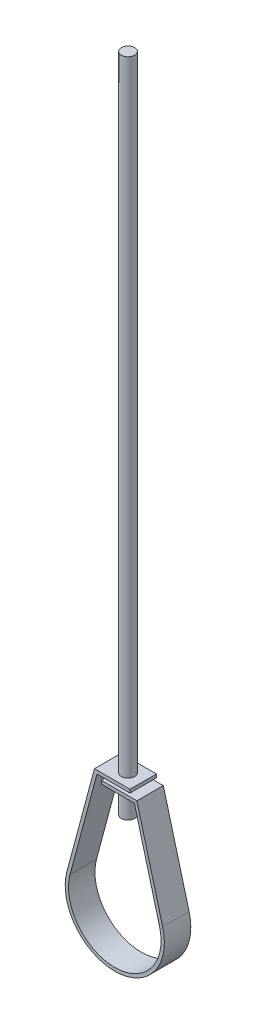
ISO-10303-21;
HEADER;
FILE_DESCRIPTION(('STEP AP214'),'2;1');
FILE_NAME('part.step','',(''),(''),'','','');
FILE_SCHEMA(('AUTOMOTIVE_DESIGN { 1 0 10303 214 1 1 1 1 }'));
ENDSEC;
DATA;
#1=APPLICATION_CONTEXT('core data for automotive mechanical design processes');
#2=APPLICATION_PROTOCOL_DEFINITION('international standard','automotive_design',2000,#1);
#3=PRODUCT_CONTEXT('',#1,'mechanical');
#4=PRODUCT('Part','Part','',(#3));
#5=PRODUCT_RELATED_PRODUCT_CATEGORY('part','',(#4));
#6=PRODUCT_DEFINITION_FORMATION('','',#4);
#7=PRODUCT_DEFINITION_CONTEXT('part definition',#1,'design');
#8=PRODUCT_DEFINITION('design','',#6,#7);
#9=PRODUCT_DEFINITION_SHAPE('','',#8);
#10=(LENGTH_UNIT() NAMED_UNIT(*) SI_UNIT(.MILLI.,.METRE.));
#11=(NAMED_UNIT(*) PLANE_ANGLE_UNIT() SI_UNIT($,.RADIAN.));
#12=(NAMED_UNIT(*) SI_UNIT($,.STERADIAN.) SOLID_ANGLE_UNIT());
#13=UNCERTAINTY_MEASURE_WITH_UNIT(LENGTH_MEASURE(1.E-05),#10,'distance_accuracy_value','');
#14=(GEOMETRIC_REPRESENTATION_CONTEXT(3) GLOBAL_UNCERTAINTY_ASSIGNED_CONTEXT((#13)) GLOBAL_UNIT_ASSIGNED_CONTEXT((#10,
#11,#12)) REPRESENTATION_CONTEXT('',''));
#15=CARTESIAN_POINT('',(0.,0.,0.));
#16=DIRECTION('',(0.,0.,1.));
#17=DIRECTION('',(1.,0.,0.));
#18=AXIS2_PLACEMENT_3D('',#15,#16,#17);
#19=CARTESIAN_POINT('',(-17.0929108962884,107.95,12.7));
#20=DIRECTION('',(0.,1.,0.));
#21=DIRECTION('',(0.,0.,1.));
#22=AXIS2_PLACEMENT_3D('',#19,#20,#21);
#23=PLANE('',#22);
#24=DIRECTION('',(1.,0.,0.));
#25=VECTOR('',#24,1.);
#26=CARTESIAN_POINT('',(-17.0929108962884,107.95,-12.7));
#27=LINE('',#26,#25);
#28=CARTESIAN_POINT('',(-17.0929108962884,107.95,-12.7));
#29=VERTEX_POINT('',#28);
#30=CARTESIAN_POINT('',(14.6570891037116,107.95,-12.7));
#31=VERTEX_POINT('',#30);
#32=EDGE_CURVE('E154',#29,#31,#27,.T.);
#33=ORIENTED_EDGE('',*,*,#32,.T.);
#34=DIRECTION('',(0.,0.,-1.));
#35=VECTOR('',#34,1.);
#36=CARTESIAN_POINT('',(14.6570891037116,107.95,12.7));
#37=LINE('',#36,#35);
#38=CARTESIAN_POINT('',(14.6570891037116,107.95,12.7));
#39=VERTEX_POINT('',#38);
#40=EDGE_CURVE('E200',#39,#31,#37,.T.);
#41=ORIENTED_EDGE('',*,*,#40,.F.);
#42=DIRECTION('',(1.,0.,0.));
#43=VECTOR('',#42,1.);
#44=CARTESIAN_POINT('',(-17.0929108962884,107.95,12.7));
#45=LINE('',#44,#43);
#46=CARTESIAN_POINT('',(-17.0929108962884,107.95,12.7));
#47=VERTEX_POINT('',#46);
#48=EDGE_CURVE('E102',#47,#39,#45,.T.);
#49=ORIENTED_EDGE('',*,*,#48,.F.);
#50=DIRECTION('',(0.,0.,-1.));
#51=VECTOR('',#50,1.);
#52=CARTESIAN_POINT('',(-17.0929108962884,107.95,12.7));
#53=LINE('',#52,#51);
#54=EDGE_CURVE('E150',#47,#29,#53,.T.);
#55=ORIENTED_EDGE('',*,*,#54,.T.);
#56=EDGE_LOOP('',(#33,#41,#49,#55));
#57=FACE_BOUND('',#56,.T.);
#58=CARTESIAN_POINT('',(0.,107.95,0.));
#59=DIRECTION('',(0.,1.,0.));
#60=DIRECTION('',(0.,0.,1.));
#61=AXIS2_PLACEMENT_3D('',#58,#59,#60);
#62=CIRCLE('',#61,6.35);
#63=CARTESIAN_POINT('',(0.,107.95,-6.35));
#64=VERTEX_POINT('',#63);
#65=EDGE_CURVE('E11',#64,#64,#62,.F.);
#66=ORIENTED_EDGE('',*,*,#65,.F.);
#67=EDGE_LOOP('',(#66));
#68=FACE_BOUND('',#67,.T.);
#69=ADVANCED_FACE('F32',(#57,#68),#23,.F.);
#70=CARTESIAN_POINT('',(-17.0929108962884,111.125,12.7));
#71=DIRECTION('',(0.,1.,0.));
#72=DIRECTION('',(0.,0.,1.));
#73=AXIS2_PLACEMENT_3D('',#70,#71,#72);
#74=PLANE('',#73);
#75=DIRECTION('',(1.,0.,0.));
#76=VECTOR('',#75,1.);
#77=CARTESIAN_POINT('',(-17.0929108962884,111.125,-12.7));
#78=LINE('',#77,#76);
#79=CARTESIAN_POINT('',(-19.5291740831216,111.125,-12.7));
#80=VERTEX_POINT('',#79);
#81=CARTESIAN_POINT('',(14.6570891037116,111.125,-12.7));
#82=VERTEX_POINT('',#81);
#83=EDGE_CURVE('E161',#80,#82,#78,.T.);
#84=ORIENTED_EDGE('',*,*,#83,.F.);
#85=DIRECTION('',(0.,0.,-1.));
#86=VECTOR('',#85,1.);
#87=CARTESIAN_POINT('',(-19.5291740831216,111.125,12.7));
#88=LINE('',#87,#86);
#89=CARTESIAN_POINT('',(-19.5291740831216,111.125,12.7));
#90=VERTEX_POINT('',#89);
#91=EDGE_CURVE('E197',#90,#80,#88,.T.);
#92=ORIENTED_EDGE('',*,*,#91,.F.);
#93=DIRECTION('',(1.,0.,0.));
#94=VECTOR('',#93,1.);
#95=CARTESIAN_POINT('',(-17.0929108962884,111.125,12.7));
#96=LINE('',#95,#94);
#97=CARTESIAN_POINT('',(14.6570891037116,111.125,12.7));
#98=VERTEX_POINT('',#97);
#99=EDGE_CURVE('E301',#90,#98,#96,.T.);
#100=ORIENTED_EDGE('',*,*,#99,.T.);
#101=DIRECTION('',(0.,0.,-1.));
#102=VECTOR('',#101,1.);
#103=CARTESIAN_POINT('',(14.6570891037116,111.125,12.7));
#104=LINE('',#103,#102);
#105=EDGE_CURVE('E199',#98,#82,#104,.T.);
#106=ORIENTED_EDGE('',*,*,#105,.T.);
#107=EDGE_LOOP('',(#84,#92,#100,#106));
#108=FACE_BOUND('',#107,.T.);
#109=CARTESIAN_POINT('',(0.,111.125,0.));
#110=DIRECTION('',(0.,1.,0.));
#111=DIRECTION('',(0.,0.,1.));
#112=AXIS2_PLACEMENT_3D('',#109,#110,#111);
#113=CIRCLE('',#112,6.35);
#114=CARTESIAN_POINT('',(0.,111.125,-6.35));
#115=VERTEX_POINT('',#114);
#116=EDGE_CURVE('E158',#115,#115,#113,.F.);
#117=ORIENTED_EDGE('',*,*,#116,.T.);
#118=EDGE_LOOP('',(#117));
#119=FACE_BOUND('',#118,.T.);
#120=ADVANCED_FACE('F220',(#108,#119),#74,.T.);
#121=CARTESIAN_POINT('',(-12.9556117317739,104.775,12.7));
#122=DIRECTION('',(0.,1.,0.));
#123=DIRECTION('',(0.,0.,1.));
#124=AXIS2_PLACEMENT_3D('',#121,#122,#123);
#125=PLANE('',#124);
#126=DIRECTION('',(1.,0.,0.));
#127=VECTOR('',#126,1.);
#128=CARTESIAN_POINT('',(-12.9556117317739,104.775,-12.7));
#129=LINE('',#128,#127);
#130=CARTESIAN_POINT('',(-12.9556117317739,104.775,-12.7));
#131=VERTEX_POINT('',#130);
#132=CARTESIAN_POINT('',(21.2306514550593,104.775,-12.7));
#133=VERTEX_POINT('',#132);
#134=EDGE_CURVE('E173',#131,#133,#129,.T.);
#135=ORIENTED_EDGE('',*,*,#134,.F.);
#136=DIRECTION('',(0.,0.,-1.));
#137=VECTOR('',#136,1.);
#138=CARTESIAN_POINT('',(-12.9556117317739,104.775,12.7));
#139=LINE('',#138,#137);
#140=CARTESIAN_POINT('',(-12.9556117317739,104.775,12.7));
#141=VERTEX_POINT('',#140);
#142=EDGE_CURVE('E189',#141,#131,#139,.T.);
#143=ORIENTED_EDGE('',*,*,#142,.F.);
#144=DIRECTION('',(1.,0.,0.));
#145=VECTOR('',#144,1.);
#146=CARTESIAN_POINT('',(-12.9556117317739,104.775,12.7));
#147=LINE('',#146,#145);
#148=CARTESIAN_POINT('',(21.2306514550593,104.775,12.7));
#149=VERTEX_POINT('',#148);
#150=EDGE_CURVE('E299',#141,#149,#147,.T.);
#151=ORIENTED_EDGE('',*,*,#150,.T.);
#152=DIRECTION('',(0.,0.,-1.));
#153=VECTOR('',#152,1.);
#154=CARTESIAN_POINT('',(21.2306514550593,104.775,12.7));
#155=LINE('',#154,#153);
#156=EDGE_CURVE('E191',#149,#133,#155,.T.);
#157=ORIENTED_EDGE('',*,*,#156,.T.);
#158=EDGE_LOOP('',(#135,#143,#151,#157));
#159=FACE_BOUND('',#158,.T.);
#160=CARTESIAN_POINT('',(0.,104.775,0.));
#161=DIRECTION('',(0.,1.,0.));
#162=DIRECTION('',(0.,0.,1.));
#163=AXIS2_PLACEMENT_3D('',#160,#161,#162);
#164=CIRCLE('',#163,6.35);
#165=CARTESIAN_POINT('',(0.,104.775,-6.35));
#166=VERTEX_POINT('',#165);
#167=EDGE_CURVE('E322',#166,#166,#164,.F.);
#168=ORIENTED_EDGE('',*,*,#167,.T.);
#169=EDGE_LOOP('',(#168));
#170=FACE_BOUND('',#169,.T.);
#171=ADVANCED_FACE('F212',(#159,#170),#125,.T.);
#172=CARTESIAN_POINT('',(-12.9556117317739,101.6,12.7));
#173=DIRECTION('',(0.,1.,0.));
#174=DIRECTION('',(0.,0.,1.));
#175=AXIS2_PLACEMENT_3D('',#172,#173,#174);
#176=PLANE('',#175);
#177=DIRECTION('',(1.,0.,0.));
#178=VECTOR('',#177,1.);
#179=CARTESIAN_POINT('',(-12.9556117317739,101.6,-12.7));
#180=LINE('',#179,#178);
#181=CARTESIAN_POINT('',(-12.9556117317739,101.6,-12.7));
#182=VERTEX_POINT('',#181);
#183=CARTESIAN_POINT('',(18.7943882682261,101.6,-12.7));
#184=VERTEX_POINT('',#183);
#185=EDGE_CURVE('E179',#182,#184,#180,.T.);
#186=ORIENTED_EDGE('',*,*,#185,.T.);
#187=DIRECTION('',(0.,0.,-1.));
#188=VECTOR('',#187,1.);
#189=CARTESIAN_POINT('',(18.7943882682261,101.6,12.7));
#190=LINE('',#189,#188);
#191=CARTESIAN_POINT('',(18.7943882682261,101.6,12.7));
#192=VERTEX_POINT('',#191);
#193=EDGE_CURVE('E145',#192,#184,#190,.T.);
#194=ORIENTED_EDGE('',*,*,#193,.F.);
#195=DIRECTION('',(1.,0.,0.));
#196=VECTOR('',#195,1.);
#197=CARTESIAN_POINT('',(-12.9556117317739,101.6,12.7));
#198=LINE('',#197,#196);
#199=CARTESIAN_POINT('',(-12.9556117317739,101.6,12.7));
#200=VERTEX_POINT('',#199);
#201=EDGE_CURVE('E136',#200,#192,#198,.T.);
#202=ORIENTED_EDGE('',*,*,#201,.F.);
#203=DIRECTION('',(0.,0.,-1.));
#204=VECTOR('',#203,1.);
#205=CARTESIAN_POINT('',(-12.9556117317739,101.6,12.7));
#206=LINE('',#205,#204);
#207=EDGE_CURVE('E187',#200,#182,#206,.T.);
#208=ORIENTED_EDGE('',*,*,#207,.T.);
#209=EDGE_LOOP('',(#186,#194,#202,#208));
#210=FACE_BOUND('',#209,.T.);
#211=CARTESIAN_POINT('',(0.,101.6,0.));
#212=DIRECTION('',(0.,1.,0.));
#213=DIRECTION('',(0.,0.,1.));
#214=AXIS2_PLACEMENT_3D('',#211,#212,#213);
#215=CIRCLE('',#214,6.35);
#216=CARTESIAN_POINT('',(0.,101.6,-6.35));
#217=VERTEX_POINT('',#216);
#218=EDGE_CURVE('E35',#217,#217,#215,.F.);
#219=ORIENTED_EDGE('',*,*,#218,.F.);
#220=EDGE_LOOP('',(#219));
#221=FACE_BOUND('',#220,.T.);
#222=ADVANCED_FACE('F209',(#210,#221),#176,.F.);
#223=CARTESIAN_POINT('',(14.6570891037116,111.125,12.7));
#224=DIRECTION('',(1.,0.,0.));
#225=DIRECTION('',(0.,0.,-1.));
#226=AXIS2_PLACEMENT_3D('',#223,#224,#225);
#227=PLANE('',#226);
#228=DIRECTION('',(0.,-1.,0.));
#229=VECTOR('',#228,1.);
#230=CARTESIAN_POINT('',(14.6570891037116,111.125,-12.7));
#231=LINE('',#230,#229);
#232=EDGE_CURVE('E157',#82,#31,#231,.T.);
#233=ORIENTED_EDGE('',*,*,#232,.F.);
#234=ORIENTED_EDGE('',*,*,#105,.F.);
#235=DIRECTION('',(0.,-1.,0.));
#236=VECTOR('',#235,1.);
#237=CARTESIAN_POINT('',(14.6570891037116,111.125,12.7));
#238=LINE('',#237,#236);
#239=EDGE_CURVE('E313',#98,#39,#238,.T.);
#240=ORIENTED_EDGE('',*,*,#239,.T.);
#241=ORIENTED_EDGE('',*,*,#40,.T.);
#242=EDGE_LOOP('',(#233,#234,#240,#241));
#243=FACE_BOUND('',#242,.T.);
#244=ADVANCED_FACE('F211',(#243),#227,.T.);
#245=CARTESIAN_POINT('',(-46.0022174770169,12.3262570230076,12.7));
#246=DIRECTION('',(-0.965925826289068,0.258819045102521,0.));
#247=DIRECTION('',(-0.258819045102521,-0.965925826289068,0.));
#248=AXIS2_PLACEMENT_3D('',#245,#246,#247);
#249=PLANE('',#248);
#250=DIRECTION('',(0.258819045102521,0.965925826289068,0.));
#251=VECTOR('',#250,1.);
#252=CARTESIAN_POINT('',(-46.0022174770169,12.3262570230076,-12.7));
#253=LINE('',#252,#251);
#254=CARTESIAN_POINT('',(-46.0022174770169,12.3262570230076,-12.7));
#255=VERTEX_POINT('',#254);
#256=EDGE_CURVE('E164',#255,#80,#253,.T.);
#257=ORIENTED_EDGE('',*,*,#256,.F.);
#258=DIRECTION('',(0.,0.,-1.));
#259=VECTOR('',#258,1.);
#260=CARTESIAN_POINT('',(-46.0022174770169,12.3262570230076,12.7));
#261=LINE('',#260,#259);
#262=CARTESIAN_POINT('',(-46.0022174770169,12.3262570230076,12.7));
#263=VERTEX_POINT('',#262);
#264=EDGE_CURVE('E195',#263,#255,#261,.T.);
#265=ORIENTED_EDGE('',*,*,#264,.F.);
#266=DIRECTION('',(0.258819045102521,0.965925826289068,0.));
#267=VECTOR('',#266,1.);
#268=CARTESIAN_POINT('',(-46.0022174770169,12.3262570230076,12.7));
#269=LINE('',#268,#267);
#270=EDGE_CURVE('E297',#263,#90,#269,.T.);
#271=ORIENTED_EDGE('',*,*,#270,.T.);
#272=ORIENTED_EDGE('',*,*,#91,.T.);
#273=EDGE_LOOP('',(#257,#265,#271,#272));
#274=FACE_BOUND('',#273,.T.);
#275=ADVANCED_FACE('F219',(#274),#249,.T.);
#276=CARTESIAN_POINT('',(0.,0.,12.7));
#277=DIRECTION('',(0.,0.,-1.));
#278=DIRECTION('',(-1.,0.,0.));
#279=AXIS2_PLACEMENT_3D('',#276,#277,#278);
#280=CYLINDRICAL_SURFACE('',#279,47.625);
#281=CARTESIAN_POINT('',(0.,0.,-12.7));
#282=DIRECTION('',(0.,0.,1.));
#283=DIRECTION('',(1.,0.,0.));
#284=AXIS2_PLACEMENT_3D('',#281,#282,#283);
#285=CIRCLE('',#284,47.625);
#286=CARTESIAN_POINT('',(46.0022174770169,12.3262570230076,-12.7));
#287=VERTEX_POINT('',#286);
#288=EDGE_CURVE('E167',#287,#255,#285,.F.);
#289=ORIENTED_EDGE('',*,*,#288,.F.);
#290=DIRECTION('',(0.,0.,-1.));
#291=VECTOR('',#290,1.);
#292=CARTESIAN_POINT('',(46.0022174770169,12.3262570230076,12.7));
#293=LINE('',#292,#291);
#294=CARTESIAN_POINT('',(46.0022174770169,12.3262570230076,12.7));
#295=VERTEX_POINT('',#294);
#296=EDGE_CURVE('E193',#295,#287,#293,.T.);
#297=ORIENTED_EDGE('',*,*,#296,.F.);
#298=CARTESIAN_POINT('',(0.,0.,12.7));
#299=DIRECTION('',(0.,0.,1.));
#300=DIRECTION('',(1.,0.,0.));
#301=AXIS2_PLACEMENT_3D('',#298,#299,#300);
#302=CIRCLE('',#301,47.625);
#303=EDGE_CURVE('E293',#295,#263,#302,.F.);
#304=ORIENTED_EDGE('',*,*,#303,.T.);
#305=ORIENTED_EDGE('',*,*,#264,.T.);
#306=EDGE_LOOP('',(#289,#297,#304,#305));
#307=FACE_BOUND('',#306,.T.);
#308=ADVANCED_FACE('F273',(#307),#280,.T.);
#309=CARTESIAN_POINT('',(21.8612027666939,102.421750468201,12.7));
#310=DIRECTION('',(0.965925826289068,0.258819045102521,0.));
#311=DIRECTION('',(-0.258819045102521,0.965925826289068,0.));
#312=AXIS2_PLACEMENT_3D('',#309,#310,#311);
#313=PLANE('',#312);
#314=DIRECTION('',(0.258819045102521,-0.965925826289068,0.));
#315=VECTOR('',#314,1.);
#316=CARTESIAN_POINT('',(21.8612027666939,102.421750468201,-12.7));
#317=LINE('',#316,#315);
#318=EDGE_CURVE('E170',#133,#287,#317,.T.);
#319=ORIENTED_EDGE('',*,*,#318,.F.);
#320=ORIENTED_EDGE('',*,*,#156,.F.);
#321=DIRECTION('',(0.258819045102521,-0.965925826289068,0.));
#322=VECTOR('',#321,1.);
#323=CARTESIAN_POINT('',(21.8612027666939,102.421750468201,12.7));
#324=LINE('',#323,#322);
#325=EDGE_CURVE('E296',#149,#295,#324,.T.);
#326=ORIENTED_EDGE('',*,*,#325,.T.);
#327=ORIENTED_EDGE('',*,*,#296,.T.);
#328=EDGE_LOOP('',(#319,#320,#326,#327));
#329=FACE_BOUND('',#328,.T.);
#330=ADVANCED_FACE('F268',(#329),#313,.T.);
#331=CARTESIAN_POINT('',(-12.9556117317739,101.6,12.7));
#332=DIRECTION('',(-1.,0.,0.));
#333=DIRECTION('',(0.,0.,1.));
#334=AXIS2_PLACEMENT_3D('',#331,#332,#333);
#335=PLANE('',#334);
#336=DIRECTION('',(0.,1.,0.));
#337=VECTOR('',#336,1.);
#338=CARTESIAN_POINT('',(-12.9556117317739,101.6,-12.7));
#339=LINE('',#338,#337);
#340=EDGE_CURVE('E176',#182,#131,#339,.T.);
#341=ORIENTED_EDGE('',*,*,#340,.F.);
#342=ORIENTED_EDGE('',*,*,#207,.F.);
#343=DIRECTION('',(0.,1.,0.));
#344=VECTOR('',#343,1.);
#345=CARTESIAN_POINT('',(-12.9556117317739,101.6,12.7));
#346=LINE('',#345,#344);
#347=EDGE_CURVE('E307',#200,#141,#346,.T.);
#348=ORIENTED_EDGE('',*,*,#347,.T.);
#349=ORIENTED_EDGE('',*,*,#142,.T.);
#350=EDGE_LOOP('',(#341,#342,#348,#349));
#351=FACE_BOUND('',#350,.T.);
#352=ADVANCED_FACE('F264',(#351),#335,.T.);
#353=CARTESIAN_POINT('',(18.7943882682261,101.6,12.7));
#354=DIRECTION('',(0.965925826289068,0.258819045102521,0.));
#355=DIRECTION('',(-0.258819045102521,0.965925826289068,0.));
#356=AXIS2_PLACEMENT_3D('',#353,#354,#355);
#357=PLANE('',#356);
#358=DIRECTION('',(0.258819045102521,-0.965925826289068,0.));
#359=VECTOR('',#358,1.);
#360=CARTESIAN_POINT('',(18.7943882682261,101.6,-12.7));
#361=LINE('',#360,#359);
#362=CARTESIAN_POINT('',(42.9354029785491,11.5045065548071,-12.7));
#363=VERTEX_POINT('',#362);
#364=EDGE_CURVE('E144',#184,#363,#361,.T.);
#365=ORIENTED_EDGE('',*,*,#364,.T.);
#366=DIRECTION('',(0.,0.,-1.));
#367=VECTOR('',#366,1.);
#368=CARTESIAN_POINT('',(42.9354029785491,11.5045065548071,12.7));
#369=LINE('',#368,#367);
#370=CARTESIAN_POINT('',(42.9354029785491,11.5045065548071,12.7));
#371=VERTEX_POINT('',#370);
#372=EDGE_CURVE('E141',#371,#363,#369,.T.);
#373=ORIENTED_EDGE('',*,*,#372,.F.);
#374=DIRECTION('',(0.258819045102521,-0.965925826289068,0.));
#375=VECTOR('',#374,1.);
#376=CARTESIAN_POINT('',(18.7943882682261,101.6,12.7));
#377=LINE('',#376,#375);
#378=EDGE_CURVE('E129',#192,#371,#377,.T.);
#379=ORIENTED_EDGE('',*,*,#378,.F.);
#380=ORIENTED_EDGE('',*,*,#193,.T.);
#381=EDGE_LOOP('',(#365,#373,#379,#380));
#382=FACE_BOUND('',#381,.T.);
#383=ADVANCED_FACE('F142',(#382),#357,.F.);
#384=CARTESIAN_POINT('',(0.,0.,12.7));
#385=DIRECTION('',(0.,0.,-1.));
#386=DIRECTION('',(-1.,0.,0.));
#387=AXIS2_PLACEMENT_3D('',#384,#385,#386);
#388=CYLINDRICAL_SURFACE('',#387,44.45);
#389=CARTESIAN_POINT('',(0.,0.,-12.7));
#390=DIRECTION('',(0.,0.,-1.));
#391=DIRECTION('',(-1.,0.,0.));
#392=AXIS2_PLACEMENT_3D('',#389,#390,#391);
#393=CIRCLE('',#392,44.45);
#394=CARTESIAN_POINT('',(-42.9354029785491,11.5045065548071,-12.7));
#395=VERTEX_POINT('',#394);
#396=EDGE_CURVE('E90',#363,#395,#393,.T.);
#397=ORIENTED_EDGE('',*,*,#396,.T.);
#398=DIRECTION('',(0.,0.,-1.));
#399=VECTOR('',#398,1.);
#400=CARTESIAN_POINT('',(-42.9354029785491,11.5045065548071,12.7));
#401=LINE('',#400,#399);
#402=CARTESIAN_POINT('',(-42.9354029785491,11.5045065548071,12.7));
#403=VERTEX_POINT('',#402);
#404=EDGE_CURVE('E146',#403,#395,#401,.T.);
#405=ORIENTED_EDGE('',*,*,#404,.F.);
#406=CARTESIAN_POINT('',(0.,0.,12.7));
#407=DIRECTION('',(0.,0.,-1.));
#408=DIRECTION('',(-1.,0.,0.));
#409=AXIS2_PLACEMENT_3D('',#406,#407,#408);
#410=CIRCLE('',#409,44.45);
#411=EDGE_CURVE('E133',#371,#403,#410,.T.);
#412=ORIENTED_EDGE('',*,*,#411,.F.);
#413=ORIENTED_EDGE('',*,*,#372,.T.);
#414=EDGE_LOOP('',(#397,#405,#412,#413));
#415=FACE_BOUND('',#414,.T.);
#416=ADVANCED_FACE('F148',(#415),#388,.F.);
#417=CARTESIAN_POINT('',(-42.9354029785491,11.5045065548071,12.7));
#418=DIRECTION('',(-0.965925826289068,0.258819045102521,0.));
#419=DIRECTION('',(-0.258819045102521,-0.965925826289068,0.));
#420=AXIS2_PLACEMENT_3D('',#417,#418,#419);
#421=PLANE('',#420);
#422=DIRECTION('',(0.258819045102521,0.965925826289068,0.));
#423=VECTOR('',#422,1.);
#424=CARTESIAN_POINT('',(-42.9354029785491,11.5045065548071,-12.7));
#425=LINE('',#424,#423);
#426=EDGE_CURVE('E96',#395,#29,#425,.T.);
#427=ORIENTED_EDGE('',*,*,#426,.T.);
#428=ORIENTED_EDGE('',*,*,#54,.F.);
#429=DIRECTION('',(0.258819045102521,0.965925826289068,0.));
#430=VECTOR('',#429,1.);
#431=CARTESIAN_POINT('',(-42.9354029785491,11.5045065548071,12.7));
#432=LINE('',#431,#430);
#433=EDGE_CURVE('E49',#403,#47,#432,.T.);
#434=ORIENTED_EDGE('',*,*,#433,.F.);
#435=ORIENTED_EDGE('',*,*,#404,.T.);
#436=EDGE_LOOP('',(#427,#428,#434,#435));
#437=FACE_BOUND('',#436,.T.);
#438=ADVANCED_FACE('F256',(#437),#421,.F.);
#439=CARTESIAN_POINT('',(0.,0.,12.7));
#440=DIRECTION('',(0.,0.,1.));
#441=DIRECTION('',(1.,0.,0.));
#442=AXIS2_PLACEMENT_3D('',#439,#440,#441);
#443=PLANE('',#442);
#444=ORIENTED_EDGE('',*,*,#48,.T.);
#445=ORIENTED_EDGE('',*,*,#239,.F.);
#446=ORIENTED_EDGE('',*,*,#99,.F.);
#447=ORIENTED_EDGE('',*,*,#270,.F.);
#448=ORIENTED_EDGE('',*,*,#303,.F.);
#449=ORIENTED_EDGE('',*,*,#325,.F.);
#450=ORIENTED_EDGE('',*,*,#150,.F.);
#451=ORIENTED_EDGE('',*,*,#347,.F.);
#452=ORIENTED_EDGE('',*,*,#201,.T.);
#453=ORIENTED_EDGE('',*,*,#378,.T.);
#454=ORIENTED_EDGE('',*,*,#411,.T.);
#455=ORIENTED_EDGE('',*,*,#433,.T.);
#456=EDGE_LOOP('',(#444,#445,#446,#447,#448,#449,#450,#451,#452,#453,#454,#455));
#457=FACE_BOUND('',#456,.T.);
#458=ADVANCED_FACE('F131',(#457),#443,.T.);
#459=CARTESIAN_POINT('',(0.,0.,-12.7));
#460=DIRECTION('',(0.,0.,1.));
#461=DIRECTION('',(1.,0.,0.));
#462=AXIS2_PLACEMENT_3D('',#459,#460,#461);
#463=PLANE('',#462);
#464=ORIENTED_EDGE('',*,*,#32,.F.);
#465=ORIENTED_EDGE('',*,*,#426,.F.);
#466=ORIENTED_EDGE('',*,*,#396,.F.);
#467=ORIENTED_EDGE('',*,*,#364,.F.);
#468=ORIENTED_EDGE('',*,*,#185,.F.);
#469=ORIENTED_EDGE('',*,*,#340,.T.);
#470=ORIENTED_EDGE('',*,*,#134,.T.);
#471=ORIENTED_EDGE('',*,*,#318,.T.);
#472=ORIENTED_EDGE('',*,*,#288,.T.);
#473=ORIENTED_EDGE('',*,*,#256,.T.);
#474=ORIENTED_EDGE('',*,*,#83,.T.);
#475=ORIENTED_EDGE('',*,*,#232,.T.);
#476=EDGE_LOOP('',(#464,#465,#466,#467,#468,#469,#470,#471,#472,#473,#474,#475));
#477=FACE_BOUND('',#476,.T.);
#478=ADVANCED_FACE('F255',(#477),#463,.F.);
#479=CARTESIAN_POINT('',(0.,76.2,0.));
#480=DIRECTION('',(0.,1.,0.));
#481=DIRECTION('',(0.,0.,1.));
#482=AXIS2_PLACEMENT_3D('',#479,#480,#481);
#483=PLANE('',#482);
#484=CARTESIAN_POINT('',(0.,76.2,0.));
#485=DIRECTION('',(0.,1.,0.));
#486=DIRECTION('',(0.,0.,1.));
#487=AXIS2_PLACEMENT_3D('',#484,#485,#486);
#488=CIRCLE('',#487,6.35);
#489=CARTESIAN_POINT('',(0.,76.1999999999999,-6.35));
#490=VERTEX_POINT('',#489);
#491=EDGE_CURVE('E328',#490,#490,#488,.T.);
#492=ORIENTED_EDGE('',*,*,#491,.F.);
#493=EDGE_LOOP('',(#492));
#494=FACE_BOUND('',#493,.T.);
#495=ADVANCED_FACE('F247',(#494),#483,.F.);
#496=CARTESIAN_POINT('',(0.,711.2,0.));
#497=DIRECTION('',(0.,-1.,0.));
#498=DIRECTION('',(0.,0.,-1.));
#499=AXIS2_PLACEMENT_3D('',#496,#497,#498);
#500=CYLINDRICAL_SURFACE('',#499,6.35);
#501=CARTESIAN_POINT('',(0.,76.1999999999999,-6.35));
#502=CARTESIAN_POINT('',(0.,76.4645833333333,-6.35));
#503=CARTESIAN_POINT('',(0.,76.7291666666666,-6.35));
#504=CARTESIAN_POINT('',(0.,77.2583333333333,-6.35));
#505=CARTESIAN_POINT('',(0.,77.5229166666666,-6.35));
#506=CARTESIAN_POINT('',(0.,78.0520833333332,-6.35));
#507=CARTESIAN_POINT('',(0.,78.3166666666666,-6.35));
#508=CARTESIAN_POINT('',(0.,78.8458333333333,-6.35));
#509=CARTESIAN_POINT('',(0.,79.1104166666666,-6.35));
#510=CARTESIAN_POINT('',(0.,79.6395833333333,-6.35));
#511=CARTESIAN_POINT('',(0.,79.9041666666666,-6.35));
#512=CARTESIAN_POINT('',(0.,80.4333333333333,-6.35));
#513=CARTESIAN_POINT('',(0.,80.6979166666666,-6.35));
#514=CARTESIAN_POINT('',(0.,81.2270833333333,-6.35));
#515=CARTESIAN_POINT('',(0.,81.4916666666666,-6.35));
#516=CARTESIAN_POINT('',(0.,82.0208333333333,-6.35));
#517=CARTESIAN_POINT('',(0.,82.2854166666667,-6.35));
#518=CARTESIAN_POINT('',(0.,82.8145833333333,-6.35));
#519=CARTESIAN_POINT('',(0.,83.0791666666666,-6.35));
#520=CARTESIAN_POINT('',(0.,83.6083333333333,-6.35));
#521=CARTESIAN_POINT('',(0.,83.8729166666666,-6.35));
#522=CARTESIAN_POINT('',(0.,84.4020833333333,-6.35));
#523=CARTESIAN_POINT('',(0.,84.6666666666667,-6.35));
#524=CARTESIAN_POINT('',(0.,85.1958333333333,-6.35));
#525=CARTESIAN_POINT('',(0.,85.4604166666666,-6.35));
#526=CARTESIAN_POINT('',(0.,85.9895833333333,-6.35));
#527=CARTESIAN_POINT('',(0.,86.2541666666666,-6.35));
#528=CARTESIAN_POINT('',(0.,86.7833333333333,-6.35));
#529=CARTESIAN_POINT('',(0.,87.0479166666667,-6.35));
#530=CARTESIAN_POINT('',(0.,87.5770833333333,-6.35));
#531=CARTESIAN_POINT('',(0.,87.8416666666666,-6.35));
#532=CARTESIAN_POINT('',(0.,88.3708333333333,-6.35));
#533=CARTESIAN_POINT('',(0.,88.6354166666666,-6.35));
#534=CARTESIAN_POINT('',(0.,89.1645833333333,-6.35));
#535=CARTESIAN_POINT('',(0.,89.4291666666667,-6.35));
#536=CARTESIAN_POINT('',(0.,89.9583333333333,-6.35));
#537=CARTESIAN_POINT('',(0.,90.2229166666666,-6.35));
#538=CARTESIAN_POINT('',(0.,90.7520833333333,-6.35));
#539=CARTESIAN_POINT('',(0.,91.0166666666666,-6.35));
#540=CARTESIAN_POINT('',(0.,91.5458333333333,-6.35));
#541=CARTESIAN_POINT('',(0.,91.8104166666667,-6.35));
#542=CARTESIAN_POINT('',(0.,92.3395833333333,-6.35));
#543=CARTESIAN_POINT('',(0.,92.6041666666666,-6.35));
#544=CARTESIAN_POINT('',(0.,93.1333333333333,-6.35));
#545=CARTESIAN_POINT('',(0.,93.3979166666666,-6.35));
#546=CARTESIAN_POINT('',(0.,93.9270833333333,-6.35));
#547=CARTESIAN_POINT('',(0.,94.1916666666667,-6.35));
#548=CARTESIAN_POINT('',(0.,94.7208333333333,-6.35));
#549=CARTESIAN_POINT('',(0.,94.9854166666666,-6.35));
#550=CARTESIAN_POINT('',(0.,95.5145833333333,-6.35));
#551=CARTESIAN_POINT('',(0.,95.7791666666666,-6.35));
#552=CARTESIAN_POINT('',(0.,96.3083333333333,-6.35));
#553=CARTESIAN_POINT('',(0.,96.5729166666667,-6.35));
#554=CARTESIAN_POINT('',(0.,97.1020833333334,-6.35));
#555=CARTESIAN_POINT('',(0.,97.3666666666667,-6.35));
#556=CARTESIAN_POINT('',(0.,97.8958333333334,-6.35));
#557=CARTESIAN_POINT('',(0.,98.1604166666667,-6.35));
#558=CARTESIAN_POINT('',(0.,98.6895833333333,-6.35));
#559=CARTESIAN_POINT('',(0.,98.9541666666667,-6.35));
#560=CARTESIAN_POINT('',(0.,99.4833333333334,-6.35));
#561=CARTESIAN_POINT('',(0.,99.7479166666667,-6.35));
#562=CARTESIAN_POINT('',(0.,100.277083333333,-6.35));
#563=CARTESIAN_POINT('',(0.,100.541666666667,-6.35));
#564=CARTESIAN_POINT('',(0.,101.070833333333,-6.35));
#565=CARTESIAN_POINT('',(0.,101.335416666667,-6.35));
#566=CARTESIAN_POINT('',(0.,101.6,-6.35));
#567=B_SPLINE_CURVE_WITH_KNOTS('',3,(#501,#502,#503,#504,#505,#506,#507,#508,#509,#510,#511,
#512,#513,#514,#515,#516,#517,#518,#519,#520,#521,#522,#523,#524,#525,#526,#527,#528,#529,#530,
#531,#532,#533,#534,#535,#536,#537,#538,#539,#540,#541,#542,#543,#544,#545,#546,#547,#548,#549,
#550,#551,#552,#553,#554,#555,#556,#557,#558,#559,#560,#561,#562,#563,#564,#565,#566),
.UNSPECIFIED.,.F.,.F.,(4,2,2,2,2,2,2,2,2,2,2,2,2,2,2,2,2,2,2,2,2,2,2,2,2,2,2,2,2,2,2,2,4),(0.,
0.793750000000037,1.58749999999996,2.38125,3.17500000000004,3.96874999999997,4.7625,
5.55625000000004,6.35000000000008,7.14375,7.93750000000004,8.73125000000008,9.52500000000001,
10.31875,11.1125000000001,11.90625,12.7,13.4937500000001,14.2875,15.08125,15.8750000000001,
16.66875,17.4625,18.2562500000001,19.05,19.84375,20.6375000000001,21.4312500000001,
22.2250000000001,23.0187500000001,23.8125000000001,24.6062500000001,25.4000000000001),.UNSPECIFIED.);
#568=EDGE_CURVE('BSEAM207',#490,#217,#567,.T.);
#569=ORIENTED_EDGE('',*,*,#491,.T.);
#570=ORIENTED_EDGE('',*,*,#218,.T.);
#571=ORIENTED_EDGE('',*,*,#568,.T.);
#572=ORIENTED_EDGE('',*,*,#568,.F.);
#573=EDGE_LOOP('',(#569,#571,#570,#572));
#574=FACE_BOUND('',#573,.T.);
#575=ADVANCED_FACE('F207',(#574),#500,.T.);
#576=CARTESIAN_POINT('',(0.,104.775,-6.35));
#577=CARTESIAN_POINT('',(0.,104.808072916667,-6.35));
#578=CARTESIAN_POINT('',(0.,104.841145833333,-6.35));
#579=CARTESIAN_POINT('',(0.,104.907291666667,-6.35));
#580=CARTESIAN_POINT('',(0.,104.940364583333,-6.35));
#581=CARTESIAN_POINT('',(0.,105.006510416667,-6.35));
#582=CARTESIAN_POINT('',(0.,105.039583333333,-6.35));
#583=CARTESIAN_POINT('',(0.,105.105729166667,-6.35));
#584=CARTESIAN_POINT('',(0.,105.138802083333,-6.35));
#585=CARTESIAN_POINT('',(0.,105.204947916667,-6.35));
#586=CARTESIAN_POINT('',(0.,105.238020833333,-6.35));
#587=CARTESIAN_POINT('',(0.,105.304166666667,-6.35));
#588=CARTESIAN_POINT('',(0.,105.337239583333,-6.35));
#589=CARTESIAN_POINT('',(0.,105.403385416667,-6.35));
#590=CARTESIAN_POINT('',(0.,105.436458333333,-6.35));
#591=CARTESIAN_POINT('',(0.,105.502604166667,-6.35));
#592=CARTESIAN_POINT('',(0.,105.535677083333,-6.35));
#593=CARTESIAN_POINT('',(0.,105.601822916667,-6.35));
#594=CARTESIAN_POINT('',(0.,105.634895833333,-6.35));
#595=CARTESIAN_POINT('',(0.,105.701041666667,-6.35));
#596=CARTESIAN_POINT('',(0.,105.734114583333,-6.35));
#597=CARTESIAN_POINT('',(0.,105.800260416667,-6.35));
#598=CARTESIAN_POINT('',(0.,105.833333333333,-6.35));
#599=CARTESIAN_POINT('',(0.,105.899479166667,-6.35));
#600=CARTESIAN_POINT('',(0.,105.932552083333,-6.35));
#601=CARTESIAN_POINT('',(0.,105.998697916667,-6.35));
#602=CARTESIAN_POINT('',(0.,106.031770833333,-6.35));
#603=CARTESIAN_POINT('',(0.,106.097916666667,-6.35));
#604=CARTESIAN_POINT('',(0.,106.130989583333,-6.35));
#605=CARTESIAN_POINT('',(0.,106.197135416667,-6.35));
#606=CARTESIAN_POINT('',(0.,106.230208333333,-6.35));
#607=CARTESIAN_POINT('',(0.,106.296354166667,-6.35));
#608=CARTESIAN_POINT('',(0.,106.329427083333,-6.35));
#609=CARTESIAN_POINT('',(0.,106.395572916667,-6.35));
#610=CARTESIAN_POINT('',(0.,106.428645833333,-6.35));
#611=CARTESIAN_POINT('',(0.,106.494791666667,-6.35));
#612=CARTESIAN_POINT('',(0.,106.527864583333,-6.35));
#613=CARTESIAN_POINT('',(0.,106.594010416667,-6.35));
#614=CARTESIAN_POINT('',(0.,106.627083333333,-6.35));
#615=CARTESIAN_POINT('',(0.,106.693229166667,-6.35));
#616=CARTESIAN_POINT('',(0.,106.726302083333,-6.35));
#617=CARTESIAN_POINT('',(0.,106.792447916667,-6.35));
#618=CARTESIAN_POINT('',(0.,106.825520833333,-6.35));
#619=CARTESIAN_POINT('',(0.,106.891666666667,-6.35));
#620=CARTESIAN_POINT('',(0.,106.924739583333,-6.35));
#621=CARTESIAN_POINT('',(0.,106.990885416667,-6.35));
#622=CARTESIAN_POINT('',(0.,107.023958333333,-6.35));
#623=CARTESIAN_POINT('',(0.,107.090104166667,-6.35));
#624=CARTESIAN_POINT('',(0.,107.123177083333,-6.35));
#625=CARTESIAN_POINT('',(0.,107.189322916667,-6.35));
#626=CARTESIAN_POINT('',(0.,107.222395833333,-6.35));
#627=CARTESIAN_POINT('',(0.,107.288541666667,-6.35));
#628=CARTESIAN_POINT('',(0.,107.321614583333,-6.35));
#629=CARTESIAN_POINT('',(0.,107.387760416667,-6.35));
#630=CARTESIAN_POINT('',(0.,107.420833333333,-6.35));
#631=CARTESIAN_POINT('',(0.,107.486979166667,-6.35));
#632=CARTESIAN_POINT('',(0.,107.520052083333,-6.35));
#633=CARTESIAN_POINT('',(0.,107.586197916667,-6.35));
#634=CARTESIAN_POINT('',(0.,107.619270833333,-6.35));
#635=CARTESIAN_POINT('',(0.,107.685416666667,-6.35));
#636=CARTESIAN_POINT('',(0.,107.718489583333,-6.35));
#637=CARTESIAN_POINT('',(0.,107.784635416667,-6.35));
#638=CARTESIAN_POINT('',(0.,107.817708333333,-6.35));
#639=CARTESIAN_POINT('',(0.,107.883854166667,-6.35));
#640=CARTESIAN_POINT('',(0.,107.916927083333,-6.35));
#641=CARTESIAN_POINT('',(0.,107.95,-6.35));
#642=B_SPLINE_CURVE_WITH_KNOTS('',3,(#576,#577,#578,#579,#580,#581,#582,#583,#584,#585,#586,
#587,#588,#589,#590,#591,#592,#593,#594,#595,#596,#597,#598,#599,#600,#601,#602,#603,#604,#605,
#606,#607,#608,#609,#610,#611,#612,#613,#614,#615,#616,#617,#618,#619,#620,#621,#622,#623,#624,
#625,#626,#627,#628,#629,#630,#631,#632,#633,#634,#635,#636,#637,#638,#639,#640,#641),
.UNSPECIFIED.,.F.,.F.,(4,2,2,2,2,2,2,2,2,2,2,2,2,2,2,2,2,2,2,2,2,2,2,2,2,2,2,2,2,2,2,2,4),(0.,
0.0992187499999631,0.198437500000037,0.29765625,0.396874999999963,0.496093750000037,0.5953125,
0.694531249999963,0.793749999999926,0.892968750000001,0.992187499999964,1.09140624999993,
1.190625,1.28984374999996,1.38906249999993,1.48828125,1.58749999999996,1.68671874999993,
1.7859375,1.88515624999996,1.98437499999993,2.08359375,2.18281249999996,2.28203124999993,
2.38125,2.48046874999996,2.57968749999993,2.67890624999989,2.77812499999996,2.87734374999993,
2.97656249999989,3.07578124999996,3.17499999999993),.UNSPECIFIED.);
#643=EDGE_CURVE('BSEAM236',#166,#64,#642,.T.);
#644=ORIENTED_EDGE('',*,*,#167,.F.);
#645=ORIENTED_EDGE('',*,*,#65,.T.);
#646=ORIENTED_EDGE('',*,*,#643,.T.);
#647=ORIENTED_EDGE('',*,*,#643,.F.);
#648=EDGE_LOOP('',(#644,#646,#645,#647));
#649=FACE_BOUND('',#648,.T.);
#650=ADVANCED_FACE('F236',(#649),#500,.T.);
#651=CARTESIAN_POINT('',(0.,711.2,0.));
#652=DIRECTION('',(0.,1.,0.));
#653=DIRECTION('',(0.,0.,1.));
#654=AXIS2_PLACEMENT_3D('',#651,#652,#653);
#655=CIRCLE('',#654,6.35);
#656=CARTESIAN_POINT('',(0.,711.2,-6.35));
#657=VERTEX_POINT('',#656);
#658=EDGE_CURVE('E325',#657,#657,#655,.T.);
#659=CARTESIAN_POINT('',(0.,111.125,-6.35));
#660=CARTESIAN_POINT('',(0.,117.37578125,-6.35));
#661=CARTESIAN_POINT('',(0.,123.6265625,-6.35));
#662=CARTESIAN_POINT('',(0.,136.128125,-6.35));
#663=CARTESIAN_POINT('',(0.,142.37890625,-6.35));
#664=CARTESIAN_POINT('',(0.,154.88046875,-6.35));
#665=CARTESIAN_POINT('',(0.,161.13125,-6.35));
#666=CARTESIAN_POINT('',(0.,173.6328125,-6.35));
#667=CARTESIAN_POINT('',(0.,179.88359375,-6.35));
#668=CARTESIAN_POINT('',(0.,192.38515625,-6.35));
#669=CARTESIAN_POINT('',(0.,198.6359375,-6.35));
#670=CARTESIAN_POINT('',(0.,211.1375,-6.35));
#671=CARTESIAN_POINT('',(0.,217.38828125,-6.35));
#672=CARTESIAN_POINT('',(0.,229.88984375,-6.35));
#673=CARTESIAN_POINT('',(0.,236.140625,-6.35));
#674=CARTESIAN_POINT('',(0.,248.6421875,-6.35));
#675=CARTESIAN_POINT('',(0.,254.89296875,-6.35));
#676=CARTESIAN_POINT('',(0.,267.39453125,-6.35));
#677=CARTESIAN_POINT('',(0.,273.6453125,-6.35));
#678=CARTESIAN_POINT('',(0.,286.146875,-6.35));
#679=CARTESIAN_POINT('',(0.,292.39765625,-6.35));
#680=CARTESIAN_POINT('',(0.,304.89921875,-6.35));
#681=CARTESIAN_POINT('',(0.,311.15,-6.35));
#682=CARTESIAN_POINT('',(0.,323.6515625,-6.35));
#683=CARTESIAN_POINT('',(0.,329.90234375,-6.35));
#684=CARTESIAN_POINT('',(0.,342.40390625,-6.35));
#685=CARTESIAN_POINT('',(0.,348.6546875,-6.35));
#686=CARTESIAN_POINT('',(0.,361.15625,-6.35));
#687=CARTESIAN_POINT('',(0.,367.40703125,-6.35));
#688=CARTESIAN_POINT('',(0.,379.90859375,-6.35));
#689=CARTESIAN_POINT('',(0.,386.159375,-6.35));
#690=CARTESIAN_POINT('',(0.,398.6609375,-6.35));
#691=CARTESIAN_POINT('',(0.,404.91171875,-6.35));
#692=CARTESIAN_POINT('',(0.,417.41328125,-6.35));
#693=CARTESIAN_POINT('',(0.,423.6640625,-6.35));
#694=CARTESIAN_POINT('',(0.,436.165625,-6.35));
#695=CARTESIAN_POINT('',(0.,442.41640625,-6.35));
#696=CARTESIAN_POINT('',(0.,454.91796875,-6.35));
#697=CARTESIAN_POINT('',(0.,461.16875,-6.35));
#698=CARTESIAN_POINT('',(0.,473.6703125,-6.35));
#699=CARTESIAN_POINT('',(0.,479.92109375,-6.35));
#700=CARTESIAN_POINT('',(0.,492.42265625,-6.35));
#701=CARTESIAN_POINT('',(0.,498.6734375,-6.35));
#702=CARTESIAN_POINT('',(0.,511.175,-6.35));
#703=CARTESIAN_POINT('',(0.,517.42578125,-6.35));
#704=CARTESIAN_POINT('',(0.,529.92734375,-6.35));
#705=CARTESIAN_POINT('',(0.,536.178125,-6.35));
#706=CARTESIAN_POINT('',(0.,548.6796875,-6.35));
#707=CARTESIAN_POINT('',(0.,554.93046875,-6.35));
#708=CARTESIAN_POINT('',(0.,567.43203125,-6.35));
#709=CARTESIAN_POINT('',(0.,573.6828125,-6.35));
#710=CARTESIAN_POINT('',(0.,586.184375,-6.35));
#711=CARTESIAN_POINT('',(0.,592.43515625,-6.35));
#712=CARTESIAN_POINT('',(0.,604.93671875,-6.35));
#713=CARTESIAN_POINT('',(0.,611.1875,-6.35));
#714=CARTESIAN_POINT('',(0.,623.6890625,-6.35));
#715=CARTESIAN_POINT('',(0.,629.93984375,-6.35));
#716=CARTESIAN_POINT('',(0.,642.44140625,-6.35));
#717=CARTESIAN_POINT('',(0.,648.6921875,-6.35));
#718=CARTESIAN_POINT('',(0.,661.19375,-6.35));
#719=CARTESIAN_POINT('',(0.,667.44453125,-6.35));
#720=CARTESIAN_POINT('',(0.,679.94609375,-6.35));
#721=CARTESIAN_POINT('',(0.,686.196875,-6.35));
#722=CARTESIAN_POINT('',(0.,698.6984375,-6.35));
#723=CARTESIAN_POINT('',(0.,704.94921875,-6.35));
#724=CARTESIAN_POINT('',(0.,711.2,-6.35));
#725=B_SPLINE_CURVE_WITH_KNOTS('',3,(#659,#660,#661,#662,#663,#664,#665,#666,#667,#668,#669,
#670,#671,#672,#673,#674,#675,#676,#677,#678,#679,#680,#681,#682,#683,#684,#685,#686,#687,#688,
#689,#690,#691,#692,#693,#694,#695,#696,#697,#698,#699,#700,#701,#702,#703,#704,#705,#706,#707,
#708,#709,#710,#711,#712,#713,#714,#715,#716,#717,#718,#719,#720,#721,#722,#723,#724),
.UNSPECIFIED.,.F.,.F.,(4,2,2,2,2,2,2,2,2,2,2,2,2,2,2,2,2,2,2,2,2,2,2,2,2,2,2,2,2,2,2,2,4),(0.,
18.75234375,37.5046875,56.25703125,75.009375,93.7617187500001,112.5140625,131.26640625,
150.01875,168.77109375,187.5234375,206.27578125,225.028125,243.78046875,262.5328125,
281.28515625,300.0375,318.78984375,337.5421875,356.29453125,375.046875,393.79921875,412.5515625,
431.30390625,450.05625,468.80859375,487.5609375,506.31328125,525.065625,543.81796875,
562.5703125,581.32265625,600.075),.UNSPECIFIED.);
#726=EDGE_CURVE('BSEAM238',#115,#657,#725,.T.);
#727=ORIENTED_EDGE('',*,*,#116,.F.);
#728=ORIENTED_EDGE('',*,*,#658,.F.);
#729=ORIENTED_EDGE('',*,*,#726,.T.);
#730=ORIENTED_EDGE('',*,*,#726,.F.);
#731=EDGE_LOOP('',(#727,#729,#728,#730));
#732=FACE_BOUND('',#731,.T.);
#733=ADVANCED_FACE('F238',(#732),#500,.T.);
#734=CARTESIAN_POINT('',(0.,711.2,0.));
#735=DIRECTION('',(0.,1.,0.));
#736=DIRECTION('',(0.,0.,1.));
#737=AXIS2_PLACEMENT_3D('',#734,#735,#736);
#738=PLANE('',#737);
#739=ORIENTED_EDGE('',*,*,#658,.T.);
#740=EDGE_LOOP('',(#739));
#741=FACE_BOUND('',#740,.T.);
#742=ADVANCED_FACE('F245',(#741),#738,.T.);
#743=CLOSED_SHELL('',(#69,#120,#171,#222,#244,#275,#308,#330,#352,#383,#416,#438,#458,#478,#495,
#575,#650,#733,#742));
#744=MANIFOLD_SOLID_BREP('B2',#743);
#745=ADVANCED_BREP_SHAPE_REPRESENTATION('',(#18,#744),#14);
#746=SHAPE_DEFINITION_REPRESENTATION(#9,#745);
ENDSEC;
END-ISO-10303-21;
